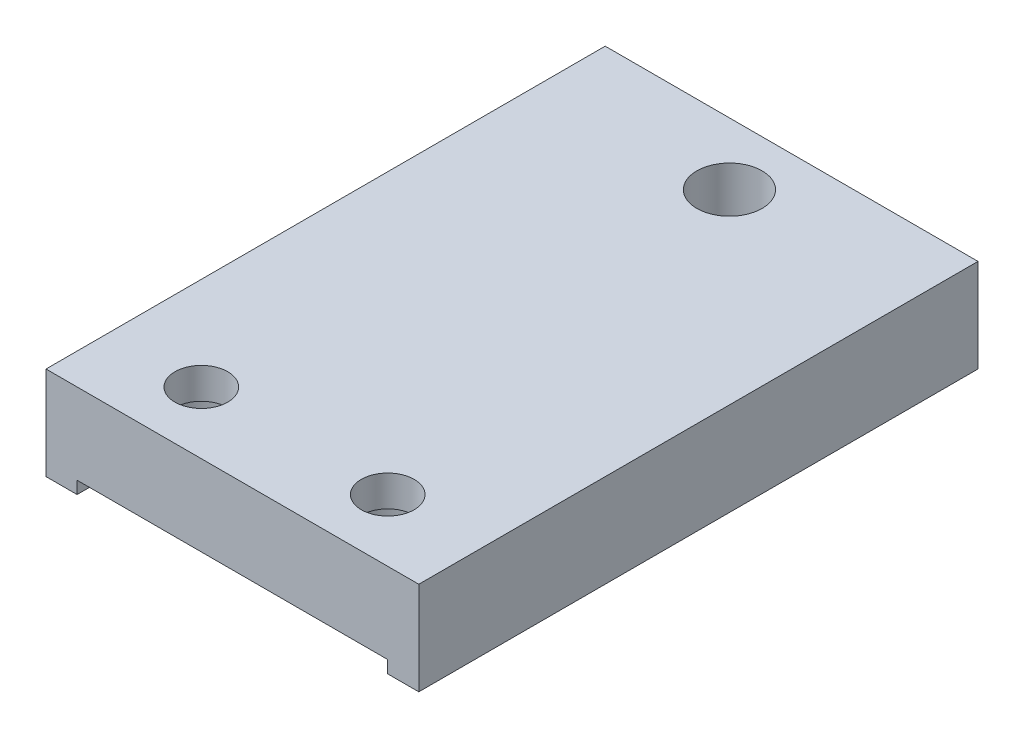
ISO-10303-21;
HEADER;
FILE_DESCRIPTION(('STEP AP214'),'2;1');
FILE_NAME('part.step','',(''),(''),'','','');
FILE_SCHEMA(('AUTOMOTIVE_DESIGN { 1 0 10303 214 1 1 1 1 }'));
ENDSEC;
DATA;
#1=APPLICATION_CONTEXT('core data for automotive mechanical design processes');
#2=APPLICATION_PROTOCOL_DEFINITION('international standard','automotive_design',2000,#1);
#3=PRODUCT_CONTEXT('',#1,'mechanical');
#4=PRODUCT('Part','Part','',(#3));
#5=PRODUCT_RELATED_PRODUCT_CATEGORY('part','',(#4));
#6=PRODUCT_DEFINITION_FORMATION('','',#4);
#7=PRODUCT_DEFINITION_CONTEXT('part definition',#1,'design');
#8=PRODUCT_DEFINITION('design','',#6,#7);
#9=PRODUCT_DEFINITION_SHAPE('','',#8);
#10=(LENGTH_UNIT() NAMED_UNIT(*) SI_UNIT(.MILLI.,.METRE.));
#11=(NAMED_UNIT(*) PLANE_ANGLE_UNIT() SI_UNIT($,.RADIAN.));
#12=(NAMED_UNIT(*) SI_UNIT($,.STERADIAN.) SOLID_ANGLE_UNIT());
#13=UNCERTAINTY_MEASURE_WITH_UNIT(LENGTH_MEASURE(1.E-05),#10,'distance_accuracy_value','');
#14=(GEOMETRIC_REPRESENTATION_CONTEXT(3) GLOBAL_UNCERTAINTY_ASSIGNED_CONTEXT((#13)) GLOBAL_UNIT_ASSIGNED_CONTEXT((#10,
#11,#12)) REPRESENTATION_CONTEXT('',''));
#15=CARTESIAN_POINT('',(0.,0.,0.));
#16=DIRECTION('',(0.,0.,1.));
#17=DIRECTION('',(1.,0.,0.));
#18=AXIS2_PLACEMENT_3D('',#15,#16,#17);
#19=CARTESIAN_POINT('',(0.,0.,90.0000000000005));
#20=DIRECTION('',(0.,1.,0.));
#21=DIRECTION('',(0.,0.,1.));
#22=AXIS2_PLACEMENT_3D('',#19,#20,#21);
#23=PLANE('',#22);
#24=DIRECTION('',(1.,0.,0.));
#25=VECTOR('',#24,1.);
#26=CARTESIAN_POINT('',(0.,0.,9.43689570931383E-13));
#27=LINE('',#26,#25);
#28=CARTESIAN_POINT('',(0.,0.,9.43689570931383E-13));
#29=VERTEX_POINT('',#28);
#30=CARTESIAN_POINT('',(5.,0.,0.));
#31=VERTEX_POINT('',#30);
#32=EDGE_CURVE('E126',#29,#31,#27,.T.);
#33=ORIENTED_EDGE('',*,*,#32,.T.);
#34=DIRECTION('',(0.,0.,1.));
#35=VECTOR('',#34,1.);
#36=CARTESIAN_POINT('',(5.,0.,0.));
#37=LINE('',#36,#35);
#38=CARTESIAN_POINT('',(5.,0.,90.0000000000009));
#39=VERTEX_POINT('',#38);
#40=EDGE_CURVE('E113',#31,#39,#37,.T.);
#41=ORIENTED_EDGE('',*,*,#40,.T.);
#42=DIRECTION('',(1.,0.,0.));
#43=VECTOR('',#42,1.);
#44=CARTESIAN_POINT('',(0.,0.,90.0000000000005));
#45=LINE('',#44,#43);
#46=CARTESIAN_POINT('',(0.,0.,90.0000000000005));
#47=VERTEX_POINT('',#46);
#48=EDGE_CURVE('E125',#47,#39,#45,.T.);
#49=ORIENTED_EDGE('',*,*,#48,.F.);
#50=DIRECTION('',(0.,0.,-1.));
#51=VECTOR('',#50,1.);
#52=CARTESIAN_POINT('',(0.,0.,90.0000000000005));
#53=LINE('',#52,#51);
#54=EDGE_CURVE('E11',#47,#29,#53,.T.);
#55=ORIENTED_EDGE('',*,*,#54,.T.);
#56=EDGE_LOOP('',(#33,#41,#49,#55));
#57=FACE_BOUND('',#56,.T.);
#58=ADVANCED_FACE('F42',(#57),#23,.F.);
#59=CARTESIAN_POINT('',(0.,0.,90.0000000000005));
#60=DIRECTION('',(1.,0.,0.));
#61=DIRECTION('',(0.,0.,-1.));
#62=AXIS2_PLACEMENT_3D('',#59,#60,#61);
#63=PLANE('',#62);
#64=DIRECTION('',(0.,-1.,0.));
#65=VECTOR('',#64,1.);
#66=CARTESIAN_POINT('',(0.,0.,9.43689570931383E-13));
#67=LINE('',#66,#65);
#68=CARTESIAN_POINT('',(0.,15.,9.43689570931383E-13));
#69=VERTEX_POINT('',#68);
#70=EDGE_CURVE('E183',#69,#29,#67,.T.);
#71=ORIENTED_EDGE('',*,*,#70,.T.);
#72=ORIENTED_EDGE('',*,*,#54,.F.);
#73=DIRECTION('',(0.,-1.,0.));
#74=VECTOR('',#73,1.);
#75=CARTESIAN_POINT('',(0.,0.,90.0000000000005));
#76=LINE('',#75,#74);
#77=CARTESIAN_POINT('',(0.,15.,90.0000000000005));
#78=VERTEX_POINT('',#77);
#79=EDGE_CURVE('E132',#78,#47,#76,.T.);
#80=ORIENTED_EDGE('',*,*,#79,.F.);
#81=DIRECTION('',(0.,0.,-1.));
#82=VECTOR('',#81,1.);
#83=CARTESIAN_POINT('',(0.,15.,90.0000000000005));
#84=LINE('',#83,#82);
#85=EDGE_CURVE('E148',#78,#69,#84,.T.);
#86=ORIENTED_EDGE('',*,*,#85,.T.);
#87=EDGE_LOOP('',(#71,#72,#80,#86));
#88=FACE_BOUND('',#87,.T.);
#89=ADVANCED_FACE('F44',(#88),#63,.F.);
#90=CARTESIAN_POINT('',(55.,0.,90.0000000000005));
#91=VERTEX_POINT('',#90);
#92=CARTESIAN_POINT('',(60.,0.,90.0000000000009));
#93=VERTEX_POINT('',#92);
#94=EDGE_CURVE('E136',#91,#93,#45,.T.);
#95=ORIENTED_EDGE('',*,*,#94,.F.);
#96=DIRECTION('',(0.,0.,1.));
#97=VECTOR('',#96,1.);
#98=CARTESIAN_POINT('',(55.,0.,9.43689570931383E-13));
#99=LINE('',#98,#97);
#100=CARTESIAN_POINT('',(55.,0.,9.43689570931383E-13));
#101=VERTEX_POINT('',#100);
#102=EDGE_CURVE('E128',#101,#91,#99,.T.);
#103=ORIENTED_EDGE('',*,*,#102,.F.);
#104=CARTESIAN_POINT('',(60.,0.,9.43689570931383E-13));
#105=VERTEX_POINT('',#104);
#106=EDGE_CURVE('E173',#101,#105,#27,.T.);
#107=ORIENTED_EDGE('',*,*,#106,.T.);
#108=DIRECTION('',(0.,0.,-1.));
#109=VECTOR('',#108,1.);
#110=CARTESIAN_POINT('',(60.,0.,90.0000000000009));
#111=LINE('',#110,#109);
#112=EDGE_CURVE('E52',#93,#105,#111,.T.);
#113=ORIENTED_EDGE('',*,*,#112,.F.);
#114=EDGE_LOOP('',(#95,#103,#107,#113));
#115=FACE_BOUND('',#114,.T.);
#116=ADVANCED_FACE('F258',(#115),#23,.F.);
#117=CARTESIAN_POINT('',(60.,0.,90.0000000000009));
#118=DIRECTION('',(-1.,0.,0.));
#119=DIRECTION('',(0.,0.,1.));
#120=AXIS2_PLACEMENT_3D('',#117,#118,#119);
#121=PLANE('',#120);
#122=DIRECTION('',(0.,1.,0.));
#123=VECTOR('',#122,1.);
#124=CARTESIAN_POINT('',(60.,0.,9.43689570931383E-13));
#125=LINE('',#124,#123);
#126=CARTESIAN_POINT('',(60.,15.,9.43689570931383E-13));
#127=VERTEX_POINT('',#126);
#128=EDGE_CURVE('E165',#105,#127,#125,.T.);
#129=ORIENTED_EDGE('',*,*,#128,.T.);
#130=DIRECTION('',(0.,0.,-1.));
#131=VECTOR('',#130,1.);
#132=CARTESIAN_POINT('',(60.,15.,90.0000000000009));
#133=LINE('',#132,#131);
#134=CARTESIAN_POINT('',(60.,15.,90.0000000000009));
#135=VERTEX_POINT('',#134);
#136=EDGE_CURVE('E152',#135,#127,#133,.T.);
#137=ORIENTED_EDGE('',*,*,#136,.F.);
#138=DIRECTION('',(0.,1.,0.));
#139=VECTOR('',#138,1.);
#140=CARTESIAN_POINT('',(60.,0.,90.0000000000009));
#141=LINE('',#140,#139);
#142=EDGE_CURVE('E135',#93,#135,#141,.T.);
#143=ORIENTED_EDGE('',*,*,#142,.F.);
#144=ORIENTED_EDGE('',*,*,#112,.T.);
#145=EDGE_LOOP('',(#129,#137,#143,#144));
#146=FACE_BOUND('',#145,.T.);
#147=ADVANCED_FACE('F163',(#146),#121,.F.);
#148=CARTESIAN_POINT('',(0.,15.,90.0000000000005));
#149=DIRECTION('',(0.,-1.,0.));
#150=DIRECTION('',(0.,0.,-1.));
#151=AXIS2_PLACEMENT_3D('',#148,#149,#150);
#152=PLANE('',#151);
#153=CARTESIAN_POINT('',(30.,15.,10.000000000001));
#154=DIRECTION('',(0.,1.,0.));
#155=DIRECTION('',(0.,0.,1.));
#156=AXIS2_PLACEMENT_3D('',#153,#154,#155);
#157=CIRCLE('',#156,5.25);
#158=CARTESIAN_POINT('',(30.,15.,15.250000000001));
#159=VERTEX_POINT('',#158);
#160=EDGE_CURVE('E235',#159,#159,#157,.T.);
#161=ORIENTED_EDGE('',*,*,#160,.F.);
#162=EDGE_LOOP('',(#161));
#163=FACE_BOUND('',#162,.T.);
#164=CARTESIAN_POINT('',(15.,15.,80.0000000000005));
#165=DIRECTION('',(0.,-1.,0.));
#166=DIRECTION('',(0.,0.,-1.));
#167=AXIS2_PLACEMENT_3D('',#164,#165,#166);
#168=CIRCLE('',#167,4.25);
#169=CARTESIAN_POINT('',(15.,15.,75.7500000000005));
#170=VERTEX_POINT('',#169);
#171=EDGE_CURVE('E231',#170,#170,#168,.T.);
#172=ORIENTED_EDGE('',*,*,#171,.T.);
#173=EDGE_LOOP('',(#172));
#174=FACE_BOUND('',#173,.T.);
#175=CARTESIAN_POINT('',(45.,15.,80.0000000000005));
#176=DIRECTION('',(0.,-1.,0.));
#177=DIRECTION('',(0.,0.,-1.));
#178=AXIS2_PLACEMENT_3D('',#175,#176,#177);
#179=CIRCLE('',#178,4.25);
#180=CARTESIAN_POINT('',(45.,15.,75.7500000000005));
#181=VERTEX_POINT('',#180);
#182=EDGE_CURVE('E217',#181,#181,#179,.T.);
#183=ORIENTED_EDGE('',*,*,#182,.T.);
#184=EDGE_LOOP('',(#183));
#185=FACE_BOUND('',#184,.T.);
#186=DIRECTION('',(-1.,0.,0.));
#187=VECTOR('',#186,1.);
#188=CARTESIAN_POINT('',(0.,15.,9.43689570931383E-13));
#189=LINE('',#188,#187);
#190=EDGE_CURVE('E175',#127,#69,#189,.T.);
#191=ORIENTED_EDGE('',*,*,#190,.T.);
#192=ORIENTED_EDGE('',*,*,#85,.F.);
#193=DIRECTION('',(-1.,0.,0.));
#194=VECTOR('',#193,1.);
#195=CARTESIAN_POINT('',(0.,15.,90.0000000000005));
#196=LINE('',#195,#194);
#197=EDGE_CURVE('E67',#135,#78,#196,.T.);
#198=ORIENTED_EDGE('',*,*,#197,.F.);
#199=ORIENTED_EDGE('',*,*,#136,.T.);
#200=EDGE_LOOP('',(#191,#192,#198,#199));
#201=FACE_BOUND('',#200,.T.);
#202=ADVANCED_FACE('F268',(#163,#174,#185,#201),#152,.F.);
#203=CARTESIAN_POINT('',(0.,15.,90.0000000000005));
#204=DIRECTION('',(0.,0.,-1.));
#205=DIRECTION('',(-1.,0.,0.));
#206=AXIS2_PLACEMENT_3D('',#203,#204,#205);
#207=PLANE('',#206);
#208=ORIENTED_EDGE('',*,*,#48,.T.);
#209=DIRECTION('',(0.,-1.,0.));
#210=VECTOR('',#209,1.);
#211=CARTESIAN_POINT('',(5.,0.,90.0000000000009));
#212=LINE('',#211,#210);
#213=CARTESIAN_POINT('',(5.,2.,90.0000000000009));
#214=VERTEX_POINT('',#213);
#215=EDGE_CURVE('E109',#214,#39,#212,.T.);
#216=ORIENTED_EDGE('',*,*,#215,.F.);
#217=DIRECTION('',(-1.,0.,0.));
#218=VECTOR('',#217,1.);
#219=CARTESIAN_POINT('',(5.,2.,90.0000000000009));
#220=LINE('',#219,#218);
#221=CARTESIAN_POINT('',(55.,2.,90.0000000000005));
#222=VERTEX_POINT('',#221);
#223=EDGE_CURVE('E201',#222,#214,#220,.T.);
#224=ORIENTED_EDGE('',*,*,#223,.F.);
#225=DIRECTION('',(0.,1.,0.));
#226=VECTOR('',#225,1.);
#227=CARTESIAN_POINT('',(55.,0.,90.0000000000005));
#228=LINE('',#227,#226);
#229=EDGE_CURVE('E120',#91,#222,#228,.T.);
#230=ORIENTED_EDGE('',*,*,#229,.F.);
#231=ORIENTED_EDGE('',*,*,#94,.T.);
#232=ORIENTED_EDGE('',*,*,#142,.T.);
#233=ORIENTED_EDGE('',*,*,#197,.T.);
#234=ORIENTED_EDGE('',*,*,#79,.T.);
#235=EDGE_LOOP('',(#208,#216,#224,#230,#231,#232,#233,#234));
#236=FACE_BOUND('',#235,.T.);
#237=ADVANCED_FACE('F130',(#236),#207,.F.);
#238=CARTESIAN_POINT('',(0.,15.,9.43689570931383E-13));
#239=DIRECTION('',(0.,0.,-1.));
#240=DIRECTION('',(-1.,0.,0.));
#241=AXIS2_PLACEMENT_3D('',#238,#239,#240);
#242=PLANE('',#241);
#243=DIRECTION('',(0.,-1.,0.));
#244=VECTOR('',#243,1.);
#245=CARTESIAN_POINT('',(5.,0.,0.));
#246=LINE('',#245,#244);
#247=CARTESIAN_POINT('',(5.,2.,0.));
#248=VERTEX_POINT('',#247);
#249=EDGE_CURVE('E198',#248,#31,#246,.T.);
#250=ORIENTED_EDGE('',*,*,#249,.T.);
#251=ORIENTED_EDGE('',*,*,#32,.F.);
#252=ORIENTED_EDGE('',*,*,#70,.F.);
#253=ORIENTED_EDGE('',*,*,#190,.F.);
#254=ORIENTED_EDGE('',*,*,#128,.F.);
#255=ORIENTED_EDGE('',*,*,#106,.F.);
#256=DIRECTION('',(0.,1.,0.));
#257=VECTOR('',#256,1.);
#258=CARTESIAN_POINT('',(55.,0.,9.43689570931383E-13));
#259=LINE('',#258,#257);
#260=CARTESIAN_POINT('',(55.,2.,9.43689570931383E-13));
#261=VERTEX_POINT('',#260);
#262=EDGE_CURVE('E196',#101,#261,#259,.T.);
#263=ORIENTED_EDGE('',*,*,#262,.T.);
#264=DIRECTION('',(-1.,0.,0.));
#265=VECTOR('',#264,1.);
#266=CARTESIAN_POINT('',(5.,2.,0.));
#267=LINE('',#266,#265);
#268=EDGE_CURVE('E59',#261,#248,#267,.T.);
#269=ORIENTED_EDGE('',*,*,#268,.T.);
#270=EDGE_LOOP('',(#250,#251,#252,#253,#254,#255,#263,#269));
#271=FACE_BOUND('',#270,.T.);
#272=ADVANCED_FACE('F171',(#271),#242,.T.);
#273=CARTESIAN_POINT('',(5.,0.,0.));
#274=DIRECTION('',(-1.,0.,0.));
#275=DIRECTION('',(0.,0.,1.));
#276=AXIS2_PLACEMENT_3D('',#273,#274,#275);
#277=PLANE('',#276);
#278=ORIENTED_EDGE('',*,*,#215,.T.);
#279=ORIENTED_EDGE('',*,*,#40,.F.);
#280=ORIENTED_EDGE('',*,*,#249,.F.);
#281=DIRECTION('',(0.,0.,1.));
#282=VECTOR('',#281,1.);
#283=CARTESIAN_POINT('',(5.,2.,0.));
#284=LINE('',#283,#282);
#285=EDGE_CURVE('E115',#248,#214,#284,.T.);
#286=ORIENTED_EDGE('',*,*,#285,.T.);
#287=EDGE_LOOP('',(#278,#279,#280,#286));
#288=FACE_BOUND('',#287,.T.);
#289=ADVANCED_FACE('F111',(#288),#277,.F.);
#290=CARTESIAN_POINT('',(5.,2.,0.));
#291=DIRECTION('',(0.,1.,0.));
#292=DIRECTION('',(0.,0.,1.));
#293=AXIS2_PLACEMENT_3D('',#290,#291,#292);
#294=PLANE('',#293);
#295=CARTESIAN_POINT('',(30.,2.,10.000000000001));
#296=DIRECTION('',(0.,1.,0.));
#297=DIRECTION('',(0.,0.,1.));
#298=AXIS2_PLACEMENT_3D('',#295,#296,#297);
#299=CIRCLE('',#298,5.25);
#300=CARTESIAN_POINT('',(30.,2.,15.250000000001));
#301=VERTEX_POINT('',#300);
#302=EDGE_CURVE('E46',#301,#301,#299,.T.);
#303=ORIENTED_EDGE('',*,*,#302,.T.);
#304=EDGE_LOOP('',(#303));
#305=FACE_BOUND('',#304,.T.);
#306=CARTESIAN_POINT('',(15.,2.,80.0000000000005));
#307=DIRECTION('',(0.,-1.,0.));
#308=DIRECTION('',(0.,0.,-1.));
#309=AXIS2_PLACEMENT_3D('',#306,#307,#308);
#310=CIRCLE('',#309,7.5);
#311=CARTESIAN_POINT('',(15.,2.,72.5000000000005));
#312=VERTEX_POINT('',#311);
#313=EDGE_CURVE('E221',#312,#312,#310,.T.);
#314=ORIENTED_EDGE('',*,*,#313,.F.);
#315=EDGE_LOOP('',(#314));
#316=FACE_BOUND('',#315,.T.);
#317=CARTESIAN_POINT('',(45.,2.,80.0000000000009));
#318=DIRECTION('',(0.,-1.,0.));
#319=DIRECTION('',(0.,0.,-1.));
#320=AXIS2_PLACEMENT_3D('',#317,#318,#319);
#321=CIRCLE('',#320,7.49999999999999);
#322=CARTESIAN_POINT('',(45.,2.,72.5000000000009));
#323=VERTEX_POINT('',#322);
#324=EDGE_CURVE('E121',#323,#323,#321,.T.);
#325=ORIENTED_EDGE('',*,*,#324,.F.);
#326=EDGE_LOOP('',(#325));
#327=FACE_BOUND('',#326,.T.);
#328=ORIENTED_EDGE('',*,*,#223,.T.);
#329=ORIENTED_EDGE('',*,*,#285,.F.);
#330=ORIENTED_EDGE('',*,*,#268,.F.);
#331=DIRECTION('',(0.,0.,1.));
#332=VECTOR('',#331,1.);
#333=CARTESIAN_POINT('',(55.,2.,9.43689570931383E-13));
#334=LINE('',#333,#332);
#335=EDGE_CURVE('E189',#261,#222,#334,.T.);
#336=ORIENTED_EDGE('',*,*,#335,.T.);
#337=EDGE_LOOP('',(#328,#329,#330,#336));
#338=FACE_BOUND('',#337,.T.);
#339=ADVANCED_FACE('F244',(#305,#316,#327,#338),#294,.F.);
#340=CARTESIAN_POINT('',(55.,0.,9.43689570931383E-13));
#341=DIRECTION('',(1.,0.,0.));
#342=DIRECTION('',(0.,0.,-1.));
#343=AXIS2_PLACEMENT_3D('',#340,#341,#342);
#344=PLANE('',#343);
#345=ORIENTED_EDGE('',*,*,#229,.T.);
#346=ORIENTED_EDGE('',*,*,#335,.F.);
#347=ORIENTED_EDGE('',*,*,#262,.F.);
#348=ORIENTED_EDGE('',*,*,#102,.T.);
#349=EDGE_LOOP('',(#345,#346,#347,#348));
#350=FACE_BOUND('',#349,.T.);
#351=ADVANCED_FACE('F272',(#350),#344,.F.);
#352=CARTESIAN_POINT('',(45.,2.,80.0000000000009));
#353=DIRECTION('',(0.,-1.,0.));
#354=DIRECTION('',(0.,0.,-1.));
#355=AXIS2_PLACEMENT_3D('',#352,#353,#354);
#356=CYLINDRICAL_SURFACE('',#355,7.49999999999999);
#357=CARTESIAN_POINT('',(45.,10.,80.0000000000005));
#358=DIRECTION('',(0.,-1.,0.));
#359=DIRECTION('',(0.,0.,-1.));
#360=AXIS2_PLACEMENT_3D('',#357,#358,#359);
#361=CIRCLE('',#360,7.49999999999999);
#362=CARTESIAN_POINT('',(45.,10.,72.5000000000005));
#363=VERTEX_POINT('',#362);
#364=EDGE_CURVE('E210',#363,#363,#361,.T.);
#365=ORIENTED_EDGE('',*,*,#364,.F.);
#366=EDGE_LOOP('',(#365));
#367=FACE_BOUND('',#366,.T.);
#368=ORIENTED_EDGE('',*,*,#324,.T.);
#369=EDGE_LOOP('',(#368));
#370=FACE_BOUND('',#369,.T.);
#371=ADVANCED_FACE('F289',(#367,#370),#356,.F.);
#372=CARTESIAN_POINT('',(49.25,10.,80.0000000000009));
#373=DIRECTION('',(0.,1.,0.));
#374=DIRECTION('',(0.,0.,1.));
#375=AXIS2_PLACEMENT_3D('',#372,#373,#374);
#376=PLANE('',#375);
#377=CARTESIAN_POINT('',(45.,10.,80.0000000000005));
#378=DIRECTION('',(0.,-1.,0.));
#379=DIRECTION('',(0.,0.,-1.));
#380=AXIS2_PLACEMENT_3D('',#377,#378,#379);
#381=CIRCLE('',#380,4.25);
#382=CARTESIAN_POINT('',(45.,10.,75.7500000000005));
#383=VERTEX_POINT('',#382);
#384=EDGE_CURVE('E213',#383,#383,#381,.T.);
#385=ORIENTED_EDGE('',*,*,#384,.F.);
#386=EDGE_LOOP('',(#385));
#387=FACE_BOUND('',#386,.T.);
#388=ORIENTED_EDGE('',*,*,#364,.T.);
#389=EDGE_LOOP('',(#388));
#390=FACE_BOUND('',#389,.T.);
#391=ADVANCED_FACE('F294',(#387,#390),#376,.F.);
#392=CARTESIAN_POINT('',(45.,2.,80.0000000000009));
#393=DIRECTION('',(0.,-1.,0.));
#394=DIRECTION('',(0.,0.,-1.));
#395=AXIS2_PLACEMENT_3D('',#392,#393,#394);
#396=CYLINDRICAL_SURFACE('',#395,4.25);
#397=ORIENTED_EDGE('',*,*,#182,.F.);
#398=EDGE_LOOP('',(#397));
#399=FACE_BOUND('',#398,.T.);
#400=ORIENTED_EDGE('',*,*,#384,.T.);
#401=EDGE_LOOP('',(#400));
#402=FACE_BOUND('',#401,.T.);
#403=ADVANCED_FACE('F298',(#399,#402),#396,.F.);
#404=CARTESIAN_POINT('',(15.,2.,80.0000000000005));
#405=DIRECTION('',(0.,-1.,0.));
#406=DIRECTION('',(0.,0.,-1.));
#407=AXIS2_PLACEMENT_3D('',#404,#405,#406);
#408=CYLINDRICAL_SURFACE('',#407,7.5);
#409=CARTESIAN_POINT('',(15.,10.,80.0000000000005));
#410=DIRECTION('',(0.,-1.,0.));
#411=DIRECTION('',(0.,0.,-1.));
#412=AXIS2_PLACEMENT_3D('',#409,#410,#411);
#413=CIRCLE('',#412,7.5);
#414=CARTESIAN_POINT('',(15.,10.,72.5000000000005));
#415=VERTEX_POINT('',#414);
#416=EDGE_CURVE('E224',#415,#415,#413,.T.);
#417=ORIENTED_EDGE('',*,*,#416,.F.);
#418=EDGE_LOOP('',(#417));
#419=FACE_BOUND('',#418,.T.);
#420=ORIENTED_EDGE('',*,*,#313,.T.);
#421=EDGE_LOOP('',(#420));
#422=FACE_BOUND('',#421,.T.);
#423=ADVANCED_FACE('F302',(#419,#422),#408,.F.);
#424=CARTESIAN_POINT('',(19.25,10.,80.0000000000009));
#425=DIRECTION('',(0.,1.,0.));
#426=DIRECTION('',(0.,0.,1.));
#427=AXIS2_PLACEMENT_3D('',#424,#425,#426);
#428=PLANE('',#427);
#429=CARTESIAN_POINT('',(15.,10.,80.0000000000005));
#430=DIRECTION('',(0.,-1.,0.));
#431=DIRECTION('',(0.,0.,-1.));
#432=AXIS2_PLACEMENT_3D('',#429,#430,#431);
#433=CIRCLE('',#432,4.25);
#434=CARTESIAN_POINT('',(15.,10.,75.7500000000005));
#435=VERTEX_POINT('',#434);
#436=EDGE_CURVE('E228',#435,#435,#433,.T.);
#437=ORIENTED_EDGE('',*,*,#436,.F.);
#438=EDGE_LOOP('',(#437));
#439=FACE_BOUND('',#438,.T.);
#440=ORIENTED_EDGE('',*,*,#416,.T.);
#441=EDGE_LOOP('',(#440));
#442=FACE_BOUND('',#441,.T.);
#443=ADVANCED_FACE('F254',(#439,#442),#428,.F.);
#444=CARTESIAN_POINT('',(15.,2.,80.0000000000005));
#445=DIRECTION('',(0.,-1.,0.));
#446=DIRECTION('',(0.,0.,-1.));
#447=AXIS2_PLACEMENT_3D('',#444,#445,#446);
#448=CYLINDRICAL_SURFACE('',#447,4.25);
#449=ORIENTED_EDGE('',*,*,#171,.F.);
#450=EDGE_LOOP('',(#449));
#451=FACE_BOUND('',#450,.T.);
#452=ORIENTED_EDGE('',*,*,#436,.T.);
#453=EDGE_LOOP('',(#452));
#454=FACE_BOUND('',#453,.T.);
#455=ADVANCED_FACE('F249',(#451,#454),#448,.F.);
#456=CARTESIAN_POINT('',(30.,15.,10.000000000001));
#457=DIRECTION('',(0.,1.,0.));
#458=DIRECTION('',(0.,0.,1.));
#459=AXIS2_PLACEMENT_3D('',#456,#457,#458);
#460=CYLINDRICAL_SURFACE('',#459,5.25);
#461=ORIENTED_EDGE('',*,*,#160,.T.);
#462=EDGE_LOOP('',(#461));
#463=FACE_BOUND('',#462,.T.);
#464=ORIENTED_EDGE('',*,*,#302,.F.);
#465=EDGE_LOOP('',(#464));
#466=FACE_BOUND('',#465,.T.);
#467=ADVANCED_FACE('F247',(#463,#466),#460,.F.);
#468=CLOSED_SHELL('',(#58,#89,#116,#147,#202,#237,#272,#289,#339,#351,#371,#391,#403,#423,#443,
#455,#467));
#469=MANIFOLD_SOLID_BREP('B2',#468);
#470=ADVANCED_BREP_SHAPE_REPRESENTATION('',(#18,#469),#14);
#471=SHAPE_DEFINITION_REPRESENTATION(#9,#470);
ENDSEC;
END-ISO-10303-21;
